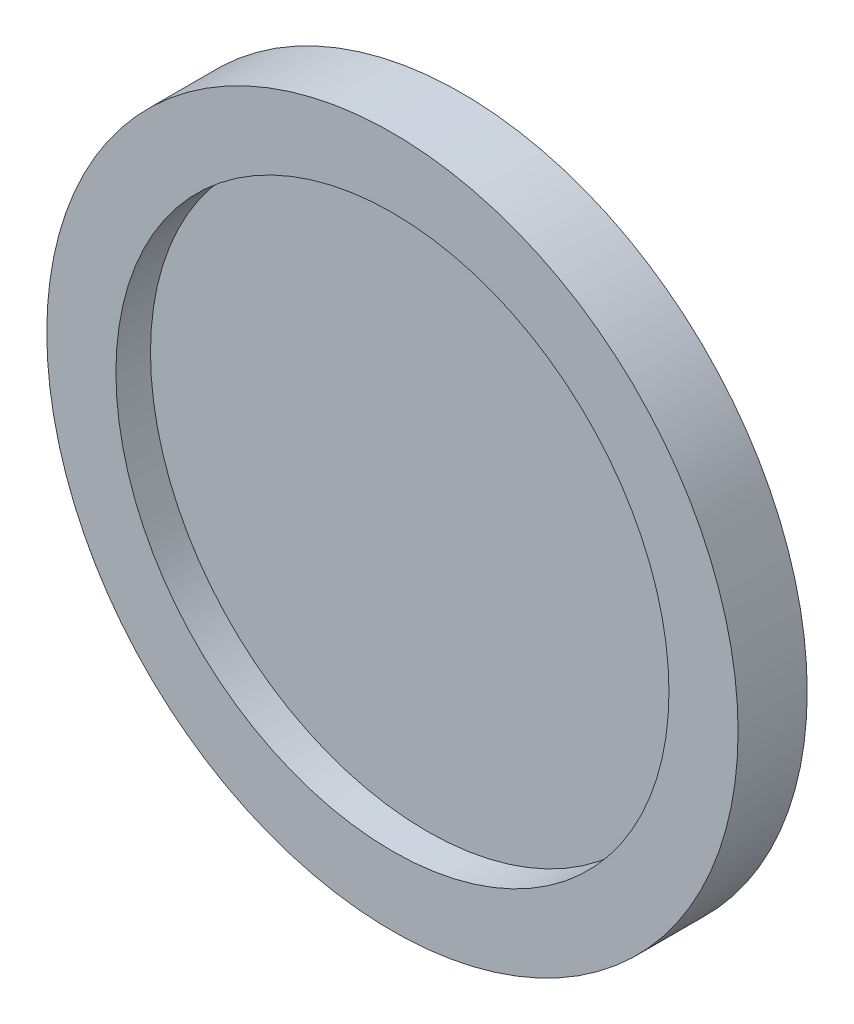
ISO-10303-21;
HEADER;
FILE_DESCRIPTION(('STEP AP214'),'2;1');
FILE_NAME('part.step','',(''),(''),'','','');
FILE_SCHEMA(('AUTOMOTIVE_DESIGN { 1 0 10303 214 1 1 1 1 }'));
ENDSEC;
DATA;
#1=APPLICATION_CONTEXT('core data for automotive mechanical design processes');
#2=APPLICATION_PROTOCOL_DEFINITION('international standard','automotive_design',2000,#1);
#3=PRODUCT_CONTEXT('',#1,'mechanical');
#4=PRODUCT('Part','Part','',(#3));
#5=PRODUCT_RELATED_PRODUCT_CATEGORY('part','',(#4));
#6=PRODUCT_DEFINITION_FORMATION('','',#4);
#7=PRODUCT_DEFINITION_CONTEXT('part definition',#1,'design');
#8=PRODUCT_DEFINITION('design','',#6,#7);
#9=PRODUCT_DEFINITION_SHAPE('','',#8);
#10=(LENGTH_UNIT() NAMED_UNIT(*) SI_UNIT(.MILLI.,.METRE.));
#11=(NAMED_UNIT(*) PLANE_ANGLE_UNIT() SI_UNIT($,.RADIAN.));
#12=(NAMED_UNIT(*) SI_UNIT($,.STERADIAN.) SOLID_ANGLE_UNIT());
#13=UNCERTAINTY_MEASURE_WITH_UNIT(LENGTH_MEASURE(1.E-05),#10,'distance_accuracy_value','');
#14=(GEOMETRIC_REPRESENTATION_CONTEXT(3) GLOBAL_UNCERTAINTY_ASSIGNED_CONTEXT((#13)) GLOBAL_UNIT_ASSIGNED_CONTEXT((#10,
#11,#12)) REPRESENTATION_CONTEXT('',''));
#15=CARTESIAN_POINT('',(0.,0.,0.));
#16=DIRECTION('',(0.,0.,1.));
#17=DIRECTION('',(1.,0.,0.));
#18=AXIS2_PLACEMENT_3D('',#15,#16,#17);
#19=CARTESIAN_POINT('',(0.,0.,1.));
#20=DIRECTION('',(0.,0.,-1.));
#21=DIRECTION('',(-1.,0.,0.));
#22=AXIS2_PLACEMENT_3D('',#19,#20,#21);
#23=CYLINDRICAL_SURFACE('',#22,5.);
#24=CARTESIAN_POINT('',(0.,0.,1.));
#25=DIRECTION('',(0.,0.,1.));
#26=DIRECTION('',(1.,0.,0.));
#27=AXIS2_PLACEMENT_3D('',#24,#25,#26);
#28=CIRCLE('',#27,5.);
#29=CARTESIAN_POINT('',(5.,0.,1.));
#30=VERTEX_POINT('',#29);
#31=EDGE_CURVE('E10',#30,#30,#28,.T.);
#32=ORIENTED_EDGE('',*,*,#31,.F.);
#33=EDGE_LOOP('',(#32));
#34=FACE_BOUND('',#33,.T.);
#35=CARTESIAN_POINT('',(0.,0.,0.));
#36=DIRECTION('',(0.,0.,1.));
#37=DIRECTION('',(1.,0.,0.));
#38=AXIS2_PLACEMENT_3D('',#35,#36,#37);
#39=CIRCLE('',#38,5.);
#40=CARTESIAN_POINT('',(5.,0.,0.));
#41=VERTEX_POINT('',#40);
#42=EDGE_CURVE('E36',#41,#41,#39,.T.);
#43=ORIENTED_EDGE('',*,*,#42,.T.);
#44=EDGE_LOOP('',(#43));
#45=FACE_BOUND('',#44,.T.);
#46=ADVANCED_FACE('F33',(#34,#45),#23,.T.);
#47=CARTESIAN_POINT('',(0.,0.,1.));
#48=DIRECTION('',(0.,0.,1.));
#49=DIRECTION('',(1.,0.,0.));
#50=AXIS2_PLACEMENT_3D('',#47,#48,#49);
#51=PLANE('',#50);
#52=CARTESIAN_POINT('',(0.,0.,1.));
#53=DIRECTION('',(0.,0.,1.));
#54=DIRECTION('',(1.,0.,0.));
#55=AXIS2_PLACEMENT_3D('',#52,#53,#54);
#56=CIRCLE('',#55,4.);
#57=CARTESIAN_POINT('',(4.,0.,1.));
#58=VERTEX_POINT('',#57);
#59=EDGE_CURVE('E45',#58,#58,#56,.T.);
#60=ORIENTED_EDGE('',*,*,#59,.F.);
#61=EDGE_LOOP('',(#60));
#62=FACE_BOUND('',#61,.T.);
#63=ORIENTED_EDGE('',*,*,#31,.T.);
#64=EDGE_LOOP('',(#63));
#65=FACE_BOUND('',#64,.T.);
#66=ADVANCED_FACE('F60',(#62,#65),#51,.T.);
#67=CARTESIAN_POINT('',(0.,0.,0.));
#68=DIRECTION('',(0.,0.,1.));
#69=DIRECTION('',(1.,0.,0.));
#70=AXIS2_PLACEMENT_3D('',#67,#68,#69);
#71=PLANE('',#70);
#72=ORIENTED_EDGE('',*,*,#42,.F.);
#73=EDGE_LOOP('',(#72));
#74=FACE_BOUND('',#73,.T.);
#75=ADVANCED_FACE('F56',(#74),#71,.F.);
#76=CARTESIAN_POINT('',(0.,0.,0.5));
#77=DIRECTION('',(0.,0.,1.));
#78=DIRECTION('',(1.,0.,0.));
#79=AXIS2_PLACEMENT_3D('',#76,#77,#78);
#80=CYLINDRICAL_SURFACE('',#79,4.);
#81=CARTESIAN_POINT('',(0.,0.,0.5));
#82=DIRECTION('',(0.,0.,1.));
#83=DIRECTION('',(1.,0.,0.));
#84=AXIS2_PLACEMENT_3D('',#81,#82,#83);
#85=CIRCLE('',#84,4.);
#86=CARTESIAN_POINT('',(4.,0.,0.5));
#87=VERTEX_POINT('',#86);
#88=EDGE_CURVE('E43',#87,#87,#85,.T.);
#89=ORIENTED_EDGE('',*,*,#88,.F.);
#90=EDGE_LOOP('',(#89));
#91=FACE_BOUND('',#90,.T.);
#92=ORIENTED_EDGE('',*,*,#59,.T.);
#93=EDGE_LOOP('',(#92));
#94=FACE_BOUND('',#93,.T.);
#95=ADVANCED_FACE('F53',(#91,#94),#80,.F.);
#96=CARTESIAN_POINT('',(0.,0.,0.5));
#97=DIRECTION('',(0.,0.,1.));
#98=DIRECTION('',(1.,0.,0.));
#99=AXIS2_PLACEMENT_3D('',#96,#97,#98);
#100=PLANE('',#99);
#101=ORIENTED_EDGE('',*,*,#88,.T.);
#102=EDGE_LOOP('',(#101));
#103=FACE_BOUND('',#102,.T.);
#104=ADVANCED_FACE('F51',(#103),#100,.T.);
#105=CLOSED_SHELL('',(#46,#66,#75,#95,#104));
#106=MANIFOLD_SOLID_BREP('B2',#105);
#107=ADVANCED_BREP_SHAPE_REPRESENTATION('',(#18,#106),#14);
#108=SHAPE_DEFINITION_REPRESENTATION(#9,#107);
ENDSEC;
END-ISO-10303-21;
